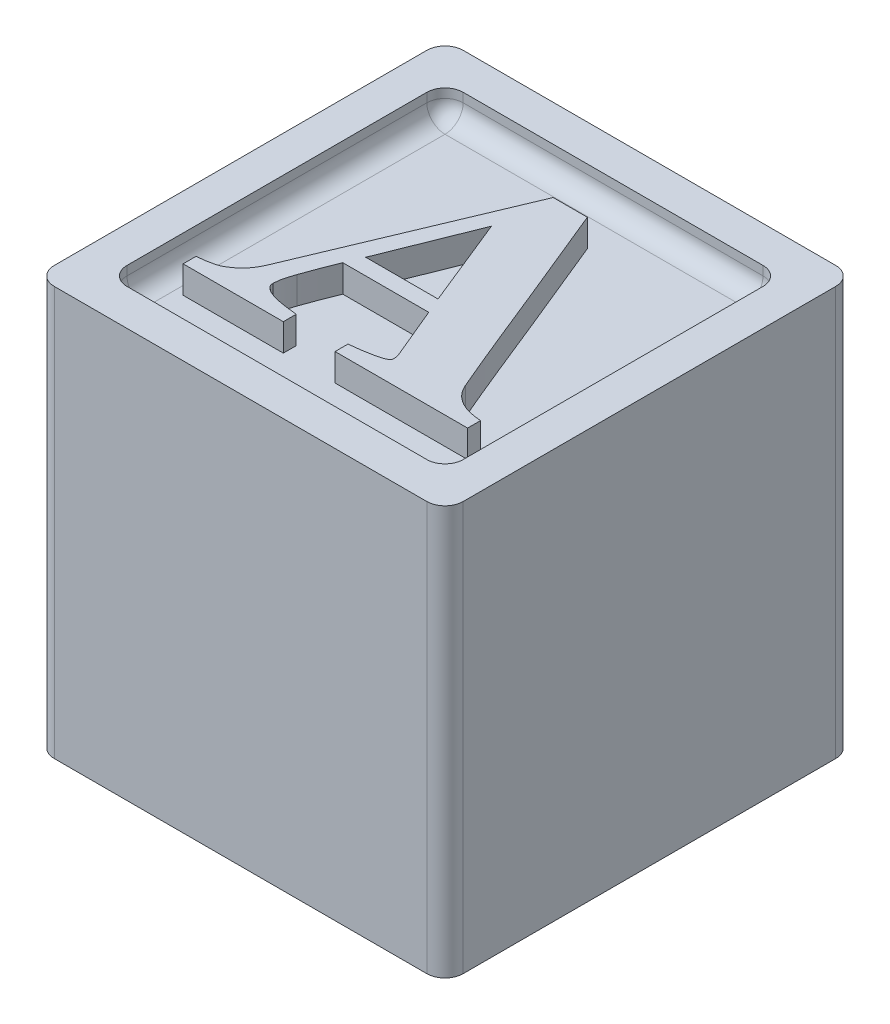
from build123d import *

# Parameters (mm, degrees)
SKETCH1_W           = 45
SKETCH1_H           = 45
BOSS_EXTRUDE1_DEPTH = 45
CUT_EXTRUDE1_DEPTH  = 3
FILLET1_R           = 2
BOSS_EXTRUDE2_DEPTH = 3
FILLET2_R           = 2
FILLET3_R           = 2


with BuildPart() as part:
    # Sketch1 → Boss-Extrude1 (new body)
    with BuildSketch(Plane(origin=(0, 0, 0), x_dir=(1, 0, 0), z_dir=(0, 1, 0))):
        with Locations((22.5, 22.5)):
            Rectangle(SKETCH1_W, SKETCH1_H)
    extrude(amount=BOSS_EXTRUDE1_DEPTH)

    # Sketch2 → Cut-Extrude1 (cut)
    with BuildSketch(Plane(origin=(0, 45, 0), x_dir=(1, 0, 0), z_dir=(0, 1, 0))):
        with BuildLine():
            Line((6, 41), (39, 41))
            ThreePointArc((39, 41), (40.414213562, 40.414213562), (41, 39))
            Line((41, 39), (41, 6))
            ThreePointArc((41, 6), (40.414213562, 4.585786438), (39, 4))
            Line((39, 4), (6, 4))
            ThreePointArc((6, 4), (4.585786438, 4.585786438), (4, 6))
            Line((4, 6), (4, 39))
            ThreePointArc((4, 39), (4.585786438, 40.414213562), (6, 41))
        make_face()
    extrude(amount=-CUT_EXTRUDE1_DEPTH, mode=Mode.SUBTRACT)

    # Fillet1
    fillet1_edges = [part.edges().sort_by_distance(p)[0] for p in [
        (40.414213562, 42, -40.414213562),
        (41, 42, -22.5),
        (40.414213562, 42, -4.585786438),
        (22.5, 42, -4),
        (4.585786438, 42, -4.585786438),
        (4, 42, -22.5),
        (4.585786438, 42, -40.414213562),
        (22.5, 42, -41),
    ]]
    fillet(fillet1_edges, radius=FILLET1_R)

    # Sketch3 → Boss-Extrude2 (add)
    with BuildSketch(Plane(origin=(0, 42, 0), x_dir=(1, 0, 0), z_dir=(0, 1, 0))):
        with BuildLine():
            Line((38.242693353, 9.243196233), (23.656388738, 9.243196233))
            Line((23.656388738, 9.243196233), (23.656388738, 10.666250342))
            add(Edge.make_bspline(
                [(23.656388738, 10.666250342), (23.840076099, 10.68078989), (24.225242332, 10.711277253), (24.822230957, 10.802993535), (25.469379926, 10.895689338), (26.022940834, 11.010248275), (26.463008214, 11.096809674), (26.751861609, 11.185019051), (27.001950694, 11.262002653), (27.202632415, 11.353541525), (27.365753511, 11.438699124), (27.476844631, 11.539421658), (27.55548257, 11.642841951), (27.565194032, 11.719511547), (27.569787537, 11.755776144)],
                knots=[0, 0, 0, 0, 1.580663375, 3.314425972, 5.180984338, 7.189265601, 8.165445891, 9.025996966, 9.780234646, 10.406650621, 10.91943364, 11.347278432, 11.691263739, 12, 12, 12, 12], degree=3))
            add(Edge.make_bspline(
                [(27.569787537, 11.755776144), (27.569435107, 11.809650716), (27.568689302, 11.923658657), (27.533827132, 12.110664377), (27.487076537, 12.345104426), (27.419571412, 12.510976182), (27.380788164, 12.606273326)],
                knots=[0, 0, 0, 0, 0.735694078, 1.556856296, 2.596357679, 4, 4, 4, 4], degree=3))
            Line((27.380788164, 12.606273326), (25.073884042, 18.137284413))
            Line((25.073884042, 18.137284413), (15.618356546, 18.137284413))
            add(Edge.make_bspline(
                [(15.618356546, 18.137284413), (15.504836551, 17.857690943), (15.261095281, 17.257369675), (14.897005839, 16.330696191), (14.552517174, 15.390865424), (14.332060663, 14.774334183), (14.228655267, 14.485149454)],
                knots=[0, 0, 0, 0, 0.926583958, 1.989488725, 3.056967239, 4, 4, 4, 4], degree=3))
            add(Edge.make_bspline(
                [(14.228655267, 14.485149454), (14.174323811, 14.322282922), (14.073992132, 14.021523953), (13.944497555, 13.605517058), (13.852124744, 13.261079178), (13.790356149, 12.921159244), (13.757506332, 12.61062748), (13.744527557, 12.391364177), (13.739480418, 12.30609785)],
                knots=[0, 0, 0, 0, 1.377792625, 2.544313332, 3.496463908, 4.237287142, 5.314522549, 6, 6, 6, 6], degree=3))
            add(Edge.make_bspline(
                [(13.739480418, 12.30609785), (13.752275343, 12.20703328), (13.779291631, 11.997859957), (13.987544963, 11.717644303), (14.302946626, 11.47080153), (14.743758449, 11.250468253), (15.325360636, 11.057952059), (16.061834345, 10.898701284), (16.958602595, 10.761686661), (17.611688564, 10.699703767), (17.964172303, 10.666250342)],
                knots=[0, 0, 0, 0, 0.491092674, 1.036934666, 1.680532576, 2.482252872, 3.47863382, 4.729366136, 6.234772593, 8, 8, 8, 8], degree=3))
            Line((17.964172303, 10.666250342), (17.964172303, 9.243196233))
            Line((17.964172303, 9.243196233), (6.93550296, 9.243196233))
            Line((6.93550296, 9.243196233), (6.93550296, 10.666250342))
            add(Edge.make_bspline(
                [(6.93550296, 10.666250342), (7.156458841, 10.68507928), (7.626766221, 10.725156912), (8.214255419, 10.83449568), (8.694916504, 10.934535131), (9.021428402, 11.044189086), (9.31379367, 11.154502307), (9.484333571, 11.253318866), (9.564817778, 11.299954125)],
                knots=[0, 0, 0, 0, 1.463204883, 3.114450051, 3.942471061, 4.700769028, 5.386843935, 6, 6, 6, 6], degree=3))
            add(Edge.make_bspline(
                [(9.564817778, 11.299954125), (9.808806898, 11.456132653), (10.289617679, 11.763901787), (10.894760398, 12.38121249), (11.401516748, 13.103822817), (11.641967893, 13.651883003), (11.766104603, 13.934827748)],
                knots=[0, 0, 0, 0, 0.990620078, 1.952139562, 2.94275964, 4, 4, 4, 4], degree=3))
            add(Edge.make_bspline(
                [(11.766104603, 13.934827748), (12.49384773, 15.674926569), (13.950269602, 19.157361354), (15.787937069, 23.531851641), (17.281093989, 27.110474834), (18.468273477, 29.928542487), (19.704638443, 32.883483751), (20.55061589, 34.89718826), (20.982603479, 35.925460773)],
                knots=[0, 0, 0, 0, 1.423871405, 2.8495734, 3.581899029, 4.351134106, 5.15802767, 6, 6, 6, 6], degree=3))
            Line((20.982603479, 35.925460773), (24.740355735, 35.925460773))
            add(Edge.make_bspline(
                [(24.740355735, 35.925460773), (25.037951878, 35.198811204), (25.616719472, 33.785616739), (26.473021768, 31.729065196), (27.262884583, 29.784355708), (28.012276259, 27.959201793), (28.701657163, 26.247813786), (29.358282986, 24.658333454), (29.948553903, 23.180808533), (30.499990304, 21.811943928), (31.011657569, 20.529416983), (31.511007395, 19.316516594), (31.980152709, 18.154453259), (32.436507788, 17.051074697), (32.870912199, 16.001880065), (33.286642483, 15.010835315), (33.682273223, 14.072862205), (33.941746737, 13.467767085), (34.068030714, 13.173271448)],
                knots=[0, 0, 0, 0, 1.532752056, 2.980909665, 4.348409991, 5.629937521, 6.832191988, 7.949838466, 8.98685575, 9.937901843, 10.830515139, 11.682178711, 12.498237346, 13.276712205, 14.012891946, 14.714850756, 15.374526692, 16, 16, 16, 16], degree=3))
            add(Edge.make_bspline(
                [(34.068030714, 13.173271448), (34.156473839, 12.994922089), (34.332453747, 12.640051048), (34.679517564, 12.137203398), (35.154116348, 11.674345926), (35.54643409, 11.431082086), (35.757907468, 11.299954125)],
                knots=[0, 0, 0, 0, 0.929211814, 1.848901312, 2.840480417, 4, 4, 4, 4], degree=3))
            add(Edge.make_bspline(
                [(35.757907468, 11.299954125), (35.94634352, 11.206794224), (36.337568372, 11.013378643), (36.978994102, 10.838934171), (37.620953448, 10.729278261), (38.044146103, 10.686377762), (38.242693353, 10.666250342)],
                knots=[0, 0, 0, 0, 0.974847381, 2.023946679, 3.072904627, 4, 4, 4, 4], degree=3))
            Line((38.242693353, 10.666250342), (38.242693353, 9.243196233))
        make_face()
        Polygon((24.317886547, 19.916102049), (20.315546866, 29.799657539), (16.357677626, 19.916102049), align=None, mode=Mode.SUBTRACT)
    extrude(amount=BOSS_EXTRUDE2_DEPTH)

    # Fillet2
    fillet2_edges = [part.edges().sort_by_distance(p)[0] for p in [
        (45, 22.5, -45),
        (45, 22.5, 0),
        (0, 22.5, 0),
    ]]
    fillet(fillet2_edges, radius=FILLET2_R)

    # Fillet3
    fillet3_edges = [part.edges().sort_by_distance(p)[0] for p in [
        (0, 22.5, -45),
    ]]
    fillet(fillet3_edges, radius=FILLET3_R)


solid = part.part
